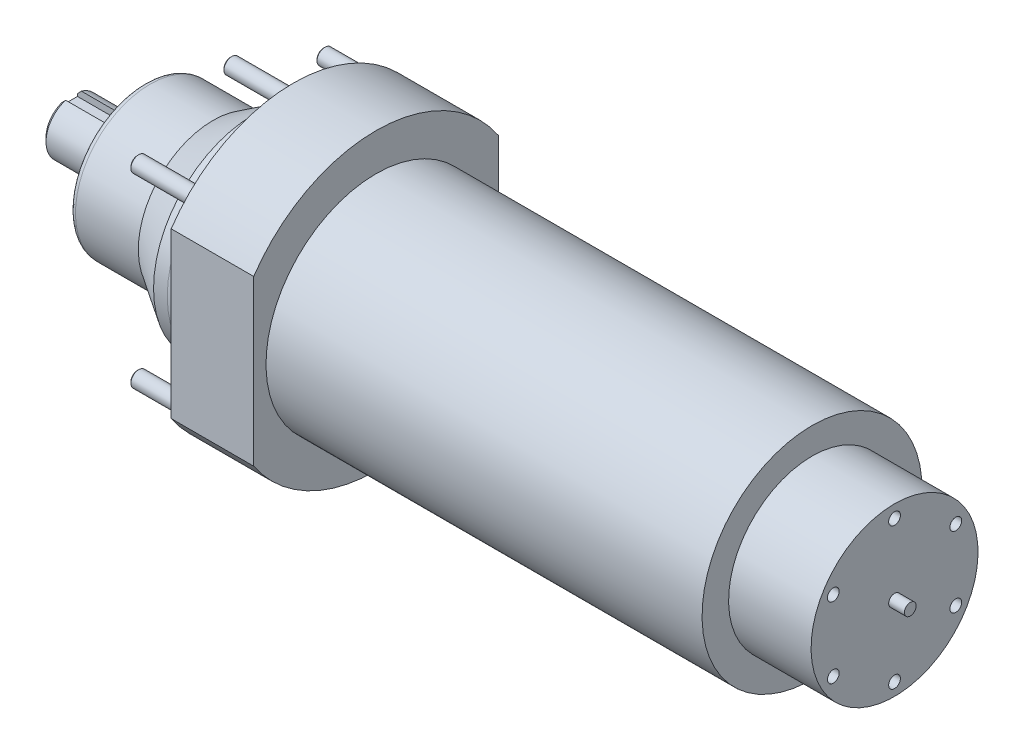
from build123d import *

# Parameters (mm, degrees)
ESQUISSE2_R                  = 3.4
ENL_V_MAT_EXTRU_1_DEPTH      = 324.86108133
R_P_TITION_CIRCULAIRE1_COUNT = 8
ENL_V_MAT_EXTRU_2_DEPTH      = 4
CHANFREIN1_SIZE              = 2
ESQUISSE8_R                  = 3
BOSS_EXTRU_1_DEPTH           = 8
ENL_V_MAT_EXTRU_3_DEPTH      = 292.948625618
ESQUISSE13_R                 = 3
ENL_V_MAT_EXTRU_5_DEPTH      = 20
ESQUISSE14_R                 = 3.4
ENL_V_MAT_EXTRU_6_DEPTH      = 16
R_P_TITION_CIRCULAIRE2_COUNT = 2
R_P_TITION_CIRCULAIRE2_ANGLE = 60
ESQUISSE16_R                 = 4
BOSS_EXTRU_2_DEPTH           = 74
CHANFREIN2_SIZE              = 0.6


with BuildPart() as part:
    # Esquisse1 → Base-R_volution (revolve)
    with BuildSketch(Plane.XY):
        with BuildLine():
            Line((-344.247442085, 0), (-344.247442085, 14))
            Line((-344.247442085, 14), (-309.247442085, 14))
            Line((-309.247442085, 14), (-309.247442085, 18))
            Line((-309.247442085, 18), (-306.247442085, 18))
            Line((-306.247442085, 18), (-306.247442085, 35))
            ThreePointArc((-306.247442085, 35), (-305.368762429, 37.121320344), (-303.247442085, 38))
            Line((-303.247442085, 38), (-271.247442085, 38))
            Line((-271.247442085, 38), (-250.247442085, 51.25))
            Line((-250.247442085, 51.25), (-243.264683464, 51.25))
            Line((-243.264683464, 51.25), (-236.247442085, 52.5))
            Line((-236.247442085, 52.5), (-230.247442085, 52.5))
            Line((-230.247442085, 52.5), (-230.247442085, 75))
            Line((-230.247442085, 75), (-188.247442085, 75))
            Line((-188.247442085, 75), (-188.247442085, 56))
            Line((-188.247442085, 56), (33.752557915, 56))
            Line((33.752557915, 56), (33.752557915, 42.5))
            Line((33.752557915, 42.5), (75.752557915, 42.5))
            Line((75.752557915, 42.5), (75.752557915, 0))
            Line((75.752557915, 0), (-344.247442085, 0))
        make_face()
    revolve(axis=Axis((80, 0, 0), (-1, 0, 0)))

    # Esquisse2 → Enl_v. mat.-Extru.1 (cut, through all)
    with BuildSketch(Plane.ZY.offset(230.247442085)):
        with Locations(Location((0, 67, 0), (0, 0, 270))):
            Circle(ESQUISSE2_R)
    enl_v_mat_extru_1 = extrude(amount=-ENL_V_MAT_EXTRU_1_DEPTH, mode=Mode.SUBTRACT)

    # R_p_tition circulaire1: Enl_v. mat.-Extru.1 ×8 about axis
    r_p_tition_circulaire1_axis = Axis((0, 0, 0), (1, 0, 0))
    for i in range(1, R_P_TITION_CIRCULAIRE1_COUNT):
        add(enl_v_mat_extru_1.rotate(r_p_tition_circulaire1_axis, i * 360 / R_P_TITION_CIRCULAIRE1_COUNT), mode=Mode.SUBTRACT)

    # Esquisse3 → Enl_v. mat.-Extru.2 (cut, symmetric)
    with BuildSketch(Plane.XY):
        with BuildLine():
            Line((-344.247442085, 14), (-344.247442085, 10.068215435))
            Line((-344.247442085, 10.068215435), (-319.298242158, 10.068215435))
            ThreePointArc((-319.298242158, 10.068215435), (-316.205798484, 11.177679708), (-314.523946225, 14))
            Line((-314.523946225, 14), (-344.247442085, 14))
        make_face()
    extrude(amount=ENL_V_MAT_EXTRU_2_DEPTH, both=True, mode=Mode.SUBTRACT)

    # Chanfrein1
    chanfrein1_edges = [part.edges().sort_by_distance(p)[0] for p in [
        (-344.247442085, -14, 0),
    ]]
    chamfer(chanfrein1_edges, length=CHANFREIN1_SIZE)

    # Esquisse8 → Boss.-Extru.1 (add)
    with BuildSketch(Plane(origin=(75.752557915, 0, 0), x_dir=(0, 0, -1), z_dir=(1, 0, 0))):
        with Locations(Location((0, 0, 0), (0, 0, 270))):
            Circle(ESQUISSE8_R)
    extrude(amount=BOSS_EXTRU_1_DEPTH)

    # Esquisse10 → Enl_v. mat.-Extru.3 (cut, through all)
    with BuildSketch(Plane(origin=(-188.247442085, 0, 0), x_dir=(0, 0, -1), z_dir=(1, 0, 0))):
        with BuildLine():
            Line((-62.25, 41.832254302), (-62.25, -41.832254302))
            ThreePointArc((-62.25, -41.832254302), (-75, 0), (-62.25, 41.832254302))
        make_face()
        with BuildLine():
            Line((62.25, 41.832254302), (62.25, -41.832254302))
            ThreePointArc((62.25, -41.832254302), (75, 0), (62.25, 41.832254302))
        make_face()
    extrude(amount=-ENL_V_MAT_EXTRU_3_DEPTH, mode=Mode.SUBTRACT)

    # Esquisse13 → Enl_v. mat.-Extru.5 (cut)
    with BuildSketch(Plane(origin=(75.752557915, 0, 0), x_dir=(0, 0, -1), z_dir=(1, 0, 0))):
        with Locations(Location((0, -36, 0), (0, 0, 90))):
            Circle(ESQUISSE13_R)
        with Locations(Location((-31.176914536, 18, 0), (0, 0, 90))):
            Circle(ESQUISSE13_R)
        with Locations(Location((31.176914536, 18, 0), (0, 0, 90))):
            Circle(ESQUISSE13_R)
    enl_v_mat_extru_5 = extrude(amount=-ENL_V_MAT_EXTRU_5_DEPTH, mode=Mode.SUBTRACT)

    # Esquisse14 → Enl_v. mat.-Extru.6 (cut)
    with BuildSketch(Plane.ZY.offset(344.247442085)):
        with Locations(Location((0, 0, 0), (0, 0, 270))):
            Circle(ESQUISSE14_R)
    extrude(amount=-ENL_V_MAT_EXTRU_6_DEPTH, mode=Mode.SUBTRACT)

    # R_p_tition circulaire2: Enl_v. mat.-Extru.5 ×2 about axis
    r_p_tition_circulaire2_axis = Axis((0, 0, 0), (-1, 0, 0))
    for i in range(1, R_P_TITION_CIRCULAIRE2_COUNT):
        add(enl_v_mat_extru_5.rotate(r_p_tition_circulaire2_axis, i * R_P_TITION_CIRCULAIRE2_ANGLE / (R_P_TITION_CIRCULAIRE2_COUNT - 1)), mode=Mode.SUBTRACT)

    # Esquisse16 → Boss.-Extru.2 (add)
    with BuildSketch(Plane(origin=(-188.247442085, 0, 0), x_dir=(0, 0, -1), z_dir=(1, 0, 0))):
        with Locations(Location((-47.376154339, 47.376154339, 0), (0, 0, 90))):
            Circle(ESQUISSE16_R)
        with Locations(Location((0, 67, 0), (0, 0, 90))):
            Circle(ESQUISSE16_R)
        with Locations(Location((47.376154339, 47.376154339, 0), (0, 0, 90))):
            Circle(ESQUISSE16_R)
        with Locations(Location((47.376154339, -47.376154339, 0), (0, 0, 90))):
            Circle(ESQUISSE16_R)
        with Locations(Location((0, -67, 0), (0, 0, 90))):
            Circle(ESQUISSE16_R)
        with Locations(Location((-47.376154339, -47.376154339, 0), (0, 0, 90))):
            Circle(ESQUISSE16_R)
    extrude(amount=-BOSS_EXTRU_2_DEPTH)

    # Chanfrein2
    chanfrein2_edges = [part.edges().sort_by_distance(p)[0] for p in [
        (-262.247442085, 43.376154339, 47.376154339),
        (-262.247442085, 63, 0),
        (-262.247442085, 43.376154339, -47.376154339),
        (-262.247442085, -51.376154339, -47.376154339),
        (-262.247442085, -71, 0),
        (-262.247442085, -51.376154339, 47.376154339),
    ]]
    chamfer(chanfrein2_edges, length=CHANFREIN2_SIZE)


solid = part.part
